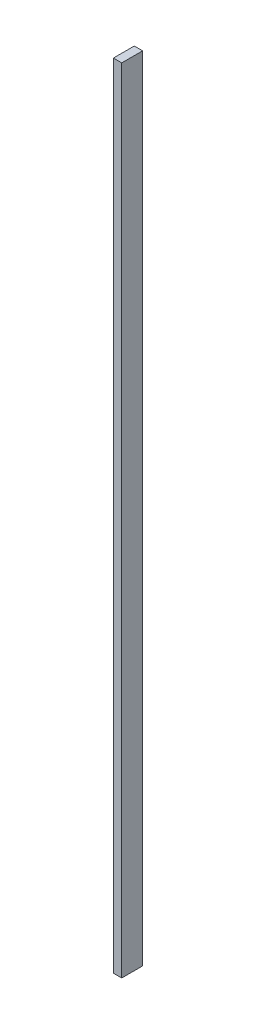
ISO-10303-21;
HEADER;
FILE_DESCRIPTION(('STEP AP214'),'2;1');
FILE_NAME('part.step','',(''),(''),'','','');
FILE_SCHEMA(('AUTOMOTIVE_DESIGN { 1 0 10303 214 1 1 1 1 }'));
ENDSEC;
DATA;
#1=APPLICATION_CONTEXT('core data for automotive mechanical design processes');
#2=APPLICATION_PROTOCOL_DEFINITION('international standard','automotive_design',2000,#1);
#3=PRODUCT_CONTEXT('',#1,'mechanical');
#4=PRODUCT('Part','Part','',(#3));
#5=PRODUCT_RELATED_PRODUCT_CATEGORY('part','',(#4));
#6=PRODUCT_DEFINITION_FORMATION('','',#4);
#7=PRODUCT_DEFINITION_CONTEXT('part definition',#1,'design');
#8=PRODUCT_DEFINITION('design','',#6,#7);
#9=PRODUCT_DEFINITION_SHAPE('','',#8);
#10=(LENGTH_UNIT() NAMED_UNIT(*) SI_UNIT(.MILLI.,.METRE.));
#11=(NAMED_UNIT(*) PLANE_ANGLE_UNIT() SI_UNIT($,.RADIAN.));
#12=(NAMED_UNIT(*) SI_UNIT($,.STERADIAN.) SOLID_ANGLE_UNIT());
#13=UNCERTAINTY_MEASURE_WITH_UNIT(LENGTH_MEASURE(1.E-05),#10,'distance_accuracy_value','');
#14=(GEOMETRIC_REPRESENTATION_CONTEXT(3) GLOBAL_UNCERTAINTY_ASSIGNED_CONTEXT((#13)) GLOBAL_UNIT_ASSIGNED_CONTEXT((#10,
#11,#12)) REPRESENTATION_CONTEXT('',''));
#15=CARTESIAN_POINT('',(0.,0.,0.));
#16=DIRECTION('',(0.,0.,1.));
#17=DIRECTION('',(1.,0.,0.));
#18=AXIS2_PLACEMENT_3D('',#15,#16,#17);
#19=CARTESIAN_POINT('',(0.,1900.,0.));
#20=DIRECTION('',(1.,0.,0.));
#21=DIRECTION('',(0.,0.,-1.));
#22=AXIS2_PLACEMENT_3D('',#19,#20,#21);
#23=PLANE('',#22);
#24=DIRECTION('',(0.,0.,1.));
#25=VECTOR('',#24,1.);
#26=CARTESIAN_POINT('',(0.,0.,0.));
#27=LINE('',#26,#25);
#28=CARTESIAN_POINT('',(0.,0.,-50.));
#29=VERTEX_POINT('',#28);
#30=CARTESIAN_POINT('',(0.,0.,0.));
#31=VERTEX_POINT('',#30);
#32=EDGE_CURVE('E95',#29,#31,#27,.T.);
#33=ORIENTED_EDGE('',*,*,#32,.T.);
#34=DIRECTION('',(0.,-1.,0.));
#35=VECTOR('',#34,1.);
#36=CARTESIAN_POINT('',(0.,1900.,0.));
#37=LINE('',#36,#35);
#38=CARTESIAN_POINT('',(0.,1900.,0.));
#39=VERTEX_POINT('',#38);
#40=EDGE_CURVE('E11',#39,#31,#37,.T.);
#41=ORIENTED_EDGE('',*,*,#40,.F.);
#42=DIRECTION('',(0.,0.,1.));
#43=VECTOR('',#42,1.);
#44=CARTESIAN_POINT('',(0.,1900.,0.));
#45=LINE('',#44,#43);
#46=CARTESIAN_POINT('',(0.,1900.,-50.));
#47=VERTEX_POINT('',#46);
#48=EDGE_CURVE('E83',#47,#39,#45,.T.);
#49=ORIENTED_EDGE('',*,*,#48,.F.);
#50=DIRECTION('',(0.,-1.,0.));
#51=VECTOR('',#50,1.);
#52=CARTESIAN_POINT('',(0.,1900.,-50.));
#53=LINE('',#52,#51);
#54=EDGE_CURVE('E91',#47,#29,#53,.T.);
#55=ORIENTED_EDGE('',*,*,#54,.T.);
#56=EDGE_LOOP('',(#33,#41,#49,#55));
#57=FACE_BOUND('',#56,.T.);
#58=ADVANCED_FACE('F32',(#57),#23,.F.);
#59=CARTESIAN_POINT('',(0.,1900.,0.));
#60=DIRECTION('',(0.,0.,-1.));
#61=DIRECTION('',(-1.,0.,0.));
#62=AXIS2_PLACEMENT_3D('',#59,#60,#61);
#63=PLANE('',#62);
#64=DIRECTION('',(1.,0.,0.));
#65=VECTOR('',#64,1.);
#66=CARTESIAN_POINT('',(0.,0.,0.));
#67=LINE('',#66,#65);
#68=CARTESIAN_POINT('',(20.,0.,0.));
#69=VERTEX_POINT('',#68);
#70=EDGE_CURVE('E87',#31,#69,#67,.T.);
#71=ORIENTED_EDGE('',*,*,#70,.T.);
#72=DIRECTION('',(0.,-1.,0.));
#73=VECTOR('',#72,1.);
#74=CARTESIAN_POINT('',(20.,1900.,0.));
#75=LINE('',#74,#73);
#76=CARTESIAN_POINT('',(20.,1900.,0.));
#77=VERTEX_POINT('',#76);
#78=EDGE_CURVE('E40',#77,#69,#75,.T.);
#79=ORIENTED_EDGE('',*,*,#78,.F.);
#80=DIRECTION('',(1.,0.,0.));
#81=VECTOR('',#80,1.);
#82=CARTESIAN_POINT('',(0.,1900.,0.));
#83=LINE('',#82,#81);
#84=EDGE_CURVE('E78',#39,#77,#83,.T.);
#85=ORIENTED_EDGE('',*,*,#84,.F.);
#86=ORIENTED_EDGE('',*,*,#40,.T.);
#87=EDGE_LOOP('',(#71,#79,#85,#86));
#88=FACE_BOUND('',#87,.T.);
#89=ADVANCED_FACE('F86',(#88),#63,.F.);
#90=CARTESIAN_POINT('',(20.,1900.,0.));
#91=DIRECTION('',(-1.,0.,0.));
#92=DIRECTION('',(0.,0.,1.));
#93=AXIS2_PLACEMENT_3D('',#90,#91,#92);
#94=PLANE('',#93);
#95=DIRECTION('',(0.,0.,-1.));
#96=VECTOR('',#95,1.);
#97=CARTESIAN_POINT('',(20.,0.,0.));
#98=LINE('',#97,#96);
#99=CARTESIAN_POINT('',(20.,0.,-50.));
#100=VERTEX_POINT('',#99);
#101=EDGE_CURVE('E65',#69,#100,#98,.T.);
#102=ORIENTED_EDGE('',*,*,#101,.T.);
#103=DIRECTION('',(0.,-1.,0.));
#104=VECTOR('',#103,1.);
#105=CARTESIAN_POINT('',(20.,1900.,-50.));
#106=LINE('',#105,#104);
#107=CARTESIAN_POINT('',(20.,1900.,-50.));
#108=VERTEX_POINT('',#107);
#109=EDGE_CURVE('E88',#108,#100,#106,.T.);
#110=ORIENTED_EDGE('',*,*,#109,.F.);
#111=DIRECTION('',(0.,0.,-1.));
#112=VECTOR('',#111,1.);
#113=CARTESIAN_POINT('',(20.,1900.,0.));
#114=LINE('',#113,#112);
#115=EDGE_CURVE('E81',#77,#108,#114,.T.);
#116=ORIENTED_EDGE('',*,*,#115,.F.);
#117=ORIENTED_EDGE('',*,*,#78,.T.);
#118=EDGE_LOOP('',(#102,#110,#116,#117));
#119=FACE_BOUND('',#118,.T.);
#120=ADVANCED_FACE('F89',(#119),#94,.F.);
#121=CARTESIAN_POINT('',(0.,1900.,-50.));
#122=DIRECTION('',(0.,0.,1.));
#123=DIRECTION('',(1.,0.,0.));
#124=AXIS2_PLACEMENT_3D('',#121,#122,#123);
#125=PLANE('',#124);
#126=DIRECTION('',(-1.,0.,0.));
#127=VECTOR('',#126,1.);
#128=CARTESIAN_POINT('',(0.,0.,-50.));
#129=LINE('',#128,#127);
#130=EDGE_CURVE('E71',#100,#29,#129,.T.);
#131=ORIENTED_EDGE('',*,*,#130,.T.);
#132=ORIENTED_EDGE('',*,*,#54,.F.);
#133=DIRECTION('',(-1.,0.,0.));
#134=VECTOR('',#133,1.);
#135=CARTESIAN_POINT('',(0.,1900.,-50.));
#136=LINE('',#135,#134);
#137=EDGE_CURVE('E48',#108,#47,#136,.T.);
#138=ORIENTED_EDGE('',*,*,#137,.F.);
#139=ORIENTED_EDGE('',*,*,#109,.T.);
#140=EDGE_LOOP('',(#131,#132,#138,#139));
#141=FACE_BOUND('',#140,.T.);
#142=ADVANCED_FACE('F102',(#141),#125,.F.);
#143=CARTESIAN_POINT('',(0.,1900.,-50.));
#144=DIRECTION('',(0.,-1.,0.));
#145=DIRECTION('',(0.,0.,-1.));
#146=AXIS2_PLACEMENT_3D('',#143,#144,#145);
#147=PLANE('',#146);
#148=ORIENTED_EDGE('',*,*,#48,.T.);
#149=ORIENTED_EDGE('',*,*,#84,.T.);
#150=ORIENTED_EDGE('',*,*,#115,.T.);
#151=ORIENTED_EDGE('',*,*,#137,.T.);
#152=EDGE_LOOP('',(#148,#149,#150,#151));
#153=FACE_BOUND('',#152,.T.);
#154=ADVANCED_FACE('F79',(#153),#147,.F.);
#155=CARTESIAN_POINT('',(0.,0.,-50.));
#156=DIRECTION('',(0.,-1.,0.));
#157=DIRECTION('',(0.,0.,-1.));
#158=AXIS2_PLACEMENT_3D('',#155,#156,#157);
#159=PLANE('',#158);
#160=ORIENTED_EDGE('',*,*,#32,.F.);
#161=ORIENTED_EDGE('',*,*,#130,.F.);
#162=ORIENTED_EDGE('',*,*,#101,.F.);
#163=ORIENTED_EDGE('',*,*,#70,.F.);
#164=EDGE_LOOP('',(#160,#161,#162,#163));
#165=FACE_BOUND('',#164,.T.);
#166=ADVANCED_FACE('F105',(#165),#159,.T.);
#167=CLOSED_SHELL('',(#58,#89,#120,#142,#154,#166));
#168=MANIFOLD_SOLID_BREP('B2',#167);
#169=ADVANCED_BREP_SHAPE_REPRESENTATION('',(#18,#168),#14);
#170=SHAPE_DEFINITION_REPRESENTATION(#9,#169);
ENDSEC;
END-ISO-10303-21;
